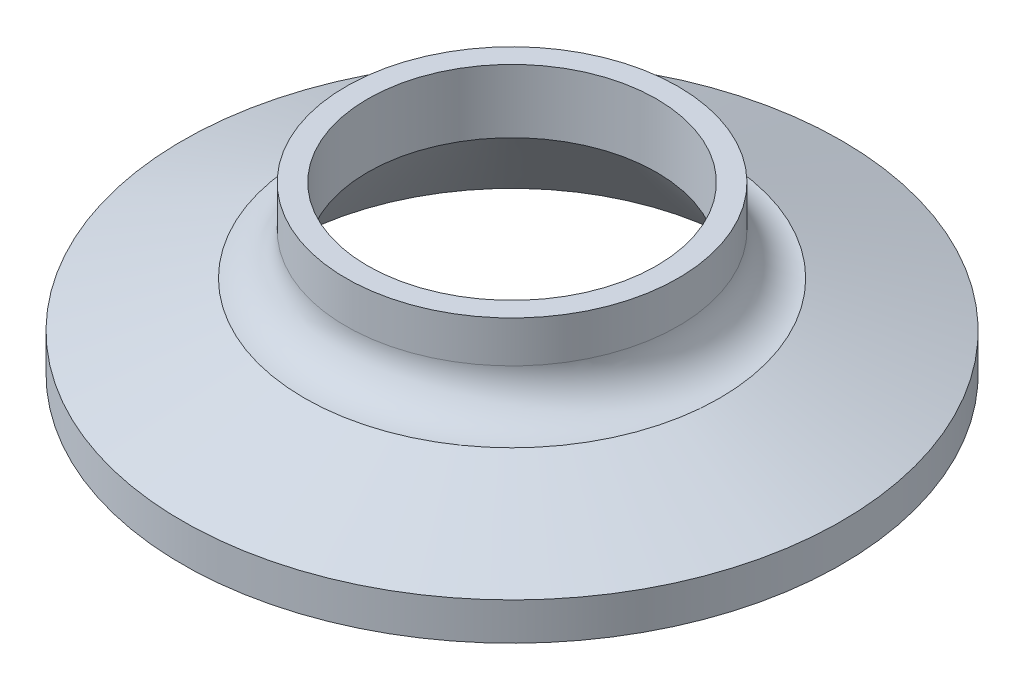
from build123d import *


with BuildPart() as part:
    # Sketch1 → Revolve1 (revolve)
    with BuildSketch(Plane.XY, mode=Mode.PRIVATE) as revolve1_sk:
        with BuildLine():
            Line((-12.7, 12.7), (-12.7, 9.525))
            ThreePointArc((-12.7, 9.525), (-13.62993597, 7.27993597), (-15.875, 6.35))
            Line((-15.875, 6.35), (-15.630196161, 6.35))
            Line((-15.630196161, 6.35), (-25.1968, 2.86804096))
            Line((-25.1968, 2.86804096), (-25.1968, 0))
            Line((-25.1968, 0), (-23.809172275, 0))
            ThreePointArc((-23.809172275, 0), (-23.374577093, 0.130798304), (-23.084366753, 0.479738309))
            Line((-23.084366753, 0.479738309), (-22.917498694, 0.872854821))
            ThreePointArc((-22.917498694, 0.872854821), (-21.8186, 1.6002), (-20.719701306, 0.872854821))
            Line((-20.719701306, 0.872854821), (-20.552833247, 0.479738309))
            ThreePointArc((-20.552833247, 0.479738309), (-20.262622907, 0.130798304), (-19.828027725, 0))
            Line((-19.828027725, 0), (-17.399, 0))
            Line((-17.399, 0), (-11.049, 7.845046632))
            Line((-11.049, 7.845046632), (-11.049, 12.7))
            Line((-11.049, 12.7), (-12.7, 12.7))
        make_face()
    revolve(revolve1_sk.sketch.rotate(Axis((0, 0, 0), (0, 1, 0)), 270), axis=Axis((0, 0, 0), (0, 1, 0)))


solid = part.part
